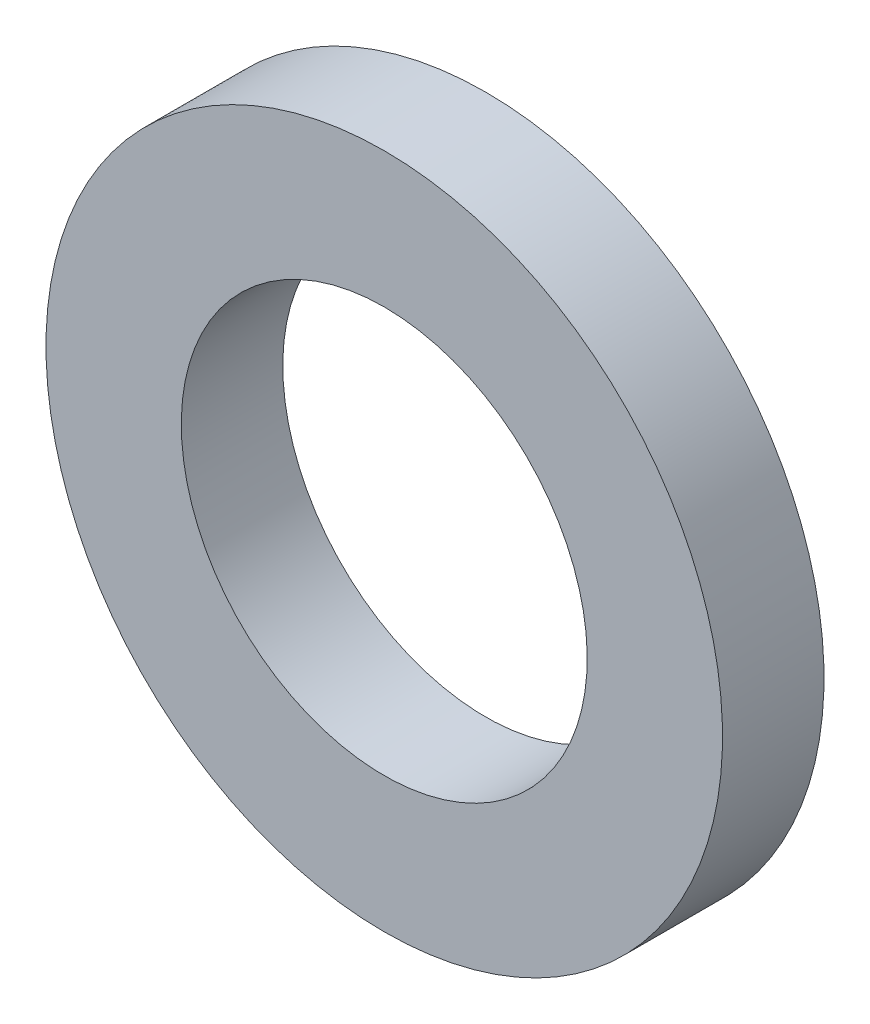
ISO-10303-21;
HEADER;
FILE_DESCRIPTION(('STEP AP214'),'2;1');
FILE_NAME('part.step','',(''),(''),'','','');
FILE_SCHEMA(('AUTOMOTIVE_DESIGN { 1 0 10303 214 1 1 1 1 }'));
ENDSEC;
DATA;
#1=APPLICATION_CONTEXT('core data for automotive mechanical design processes');
#2=APPLICATION_PROTOCOL_DEFINITION('international standard','automotive_design',2000,#1);
#3=PRODUCT_CONTEXT('',#1,'mechanical');
#4=PRODUCT('Part','Part','',(#3));
#5=PRODUCT_RELATED_PRODUCT_CATEGORY('part','',(#4));
#6=PRODUCT_DEFINITION_FORMATION('','',#4);
#7=PRODUCT_DEFINITION_CONTEXT('part definition',#1,'design');
#8=PRODUCT_DEFINITION('design','',#6,#7);
#9=PRODUCT_DEFINITION_SHAPE('','',#8);
#10=(LENGTH_UNIT() NAMED_UNIT(*) SI_UNIT(.MILLI.,.METRE.));
#11=(NAMED_UNIT(*) PLANE_ANGLE_UNIT() SI_UNIT($,.RADIAN.));
#12=(NAMED_UNIT(*) SI_UNIT($,.STERADIAN.) SOLID_ANGLE_UNIT());
#13=UNCERTAINTY_MEASURE_WITH_UNIT(LENGTH_MEASURE(1.E-05),#10,'distance_accuracy_value','');
#14=(GEOMETRIC_REPRESENTATION_CONTEXT(3) GLOBAL_UNCERTAINTY_ASSIGNED_CONTEXT((#13)) GLOBAL_UNIT_ASSIGNED_CONTEXT((#10,
#11,#12)) REPRESENTATION_CONTEXT('',''));
#15=CARTESIAN_POINT('',(0.,0.,0.));
#16=DIRECTION('',(0.,0.,1.));
#17=DIRECTION('',(1.,0.,0.));
#18=AXIS2_PLACEMENT_3D('',#15,#16,#17);
#19=CARTESIAN_POINT('',(0.,0.,0.));
#20=DIRECTION('',(0.,0.,-1.));
#21=DIRECTION('',(0.,1.,0.));
#22=AXIS2_PLACEMENT_3D('',#19,#20,#21);
#23=CYLINDRICAL_SURFACE('',#22,6.);
#24=CARTESIAN_POINT('',(0.,0.,3.));
#25=DIRECTION('',(0.,0.,-1.));
#26=DIRECTION('',(0.,1.,0.));
#27=AXIS2_PLACEMENT_3D('',#24,#25,#26);
#28=CIRCLE('',#27,6.);
#29=CARTESIAN_POINT('',(0.,6.,3.));
#30=VERTEX_POINT('',#29);
#31=EDGE_CURVE('E10',#30,#30,#28,.T.);
#32=ORIENTED_EDGE('',*,*,#31,.F.);
#33=EDGE_LOOP('',(#32));
#34=FACE_BOUND('',#33,.T.);
#35=CARTESIAN_POINT('',(0.,0.,0.));
#36=DIRECTION('',(0.,0.,-1.));
#37=DIRECTION('',(0.,1.,0.));
#38=AXIS2_PLACEMENT_3D('',#35,#36,#37);
#39=CIRCLE('',#38,6.);
#40=CARTESIAN_POINT('',(0.,6.,0.));
#41=VERTEX_POINT('',#40);
#42=EDGE_CURVE('E28',#41,#41,#39,.T.);
#43=ORIENTED_EDGE('',*,*,#42,.T.);
#44=EDGE_LOOP('',(#43));
#45=FACE_BOUND('',#44,.T.);
#46=ADVANCED_FACE('F14',(#34,#45),#23,.F.);
#47=CARTESIAN_POINT('',(10.,0.,3.));
#48=DIRECTION('',(0.,0.,1.));
#49=DIRECTION('',(0.,-1.,0.));
#50=AXIS2_PLACEMENT_3D('',#47,#48,#49);
#51=PLANE('',#50);
#52=ORIENTED_EDGE('',*,*,#31,.T.);
#53=EDGE_LOOP('',(#52));
#54=FACE_BOUND('',#53,.T.);
#55=CARTESIAN_POINT('',(0.,0.,3.));
#56=DIRECTION('',(0.,0.,-1.));
#57=DIRECTION('',(0.,1.,0.));
#58=AXIS2_PLACEMENT_3D('',#55,#56,#57);
#59=CIRCLE('',#58,10.);
#60=CARTESIAN_POINT('',(0.,10.,3.));
#61=VERTEX_POINT('',#60);
#62=EDGE_CURVE('E20',#61,#61,#59,.T.);
#63=ORIENTED_EDGE('',*,*,#62,.F.);
#64=EDGE_LOOP('',(#63));
#65=FACE_BOUND('',#64,.T.);
#66=ADVANCED_FACE('F44',(#54,#65),#51,.T.);
#67=CARTESIAN_POINT('',(0.,0.,0.));
#68=DIRECTION('',(0.,0.,-1.));
#69=DIRECTION('',(0.,1.,0.));
#70=AXIS2_PLACEMENT_3D('',#67,#68,#69);
#71=CYLINDRICAL_SURFACE('',#70,10.);
#72=ORIENTED_EDGE('',*,*,#62,.T.);
#73=EDGE_LOOP('',(#72));
#74=FACE_BOUND('',#73,.T.);
#75=CARTESIAN_POINT('',(0.,0.,0.));
#76=DIRECTION('',(0.,0.,-1.));
#77=DIRECTION('',(0.,1.,0.));
#78=AXIS2_PLACEMENT_3D('',#75,#76,#77);
#79=CIRCLE('',#78,10.);
#80=CARTESIAN_POINT('',(0.,10.,0.));
#81=VERTEX_POINT('',#80);
#82=EDGE_CURVE('E24',#81,#81,#79,.T.);
#83=ORIENTED_EDGE('',*,*,#82,.F.);
#84=EDGE_LOOP('',(#83));
#85=FACE_BOUND('',#84,.T.);
#86=ADVANCED_FACE('F37',(#74,#85),#71,.T.);
#87=CARTESIAN_POINT('',(6.,0.,0.));
#88=DIRECTION('',(0.,0.,-1.));
#89=DIRECTION('',(0.,1.,0.));
#90=AXIS2_PLACEMENT_3D('',#87,#88,#89);
#91=PLANE('',#90);
#92=ORIENTED_EDGE('',*,*,#82,.T.);
#93=EDGE_LOOP('',(#92));
#94=FACE_BOUND('',#93,.T.);
#95=ORIENTED_EDGE('',*,*,#42,.F.);
#96=EDGE_LOOP('',(#95));
#97=FACE_BOUND('',#96,.T.);
#98=ADVANCED_FACE('F35',(#94,#97),#91,.T.);
#99=CLOSED_SHELL('',(#46,#66,#86,#98));
#100=MANIFOLD_SOLID_BREP('B1',#99);
#101=ADVANCED_BREP_SHAPE_REPRESENTATION('',(#18,#100),#14);
#102=SHAPE_DEFINITION_REPRESENTATION(#9,#101);
ENDSEC;
END-ISO-10303-21;
